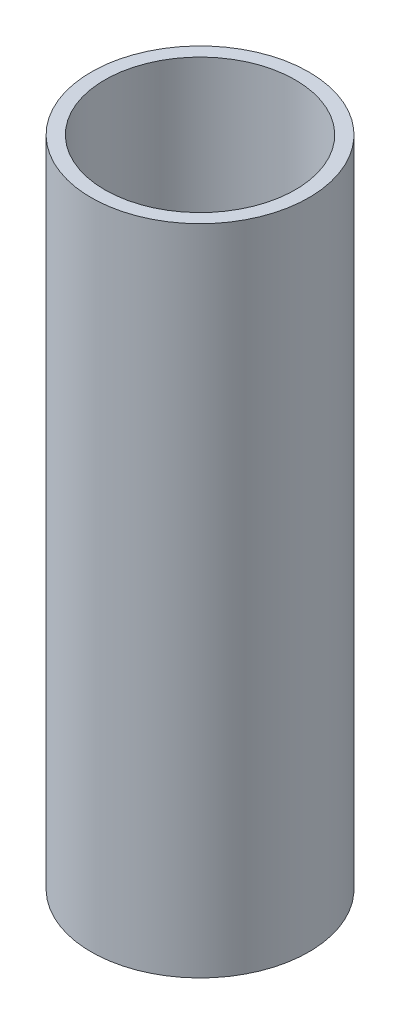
from build123d import *

# Parameters (mm, degrees)
SKETCH1_R      = 12.7
EXTRUDE1_DEPTH = 76.2
SKETCH2_R      = 11.1125
EXTRUDE2_DEPTH = 79.288057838


with BuildPart() as part:
    # Sketch1 → Extrude1 (new body)
    with BuildSketch(Plane(origin=(0, 0, 0), x_dir=(1, 0, 0), z_dir=(0, 1, 0))):
        with Locations(Location((0, 0, 0), (0, 0, 90))):
            Circle(SKETCH1_R)
    extrude(amount=EXTRUDE1_DEPTH)

    # Sketch2 → Extrude2 (cut, through all)
    with BuildSketch(Plane(origin=(0, 76.2, 0), x_dir=(1, 0, 0), z_dir=(0, 1, 0))):
        with Locations(Location((0, 0, 0), (0, 0, 270))):
            Circle(SKETCH2_R)
    extrude(amount=-EXTRUDE2_DEPTH, mode=Mode.SUBTRACT)


solid = part.part
